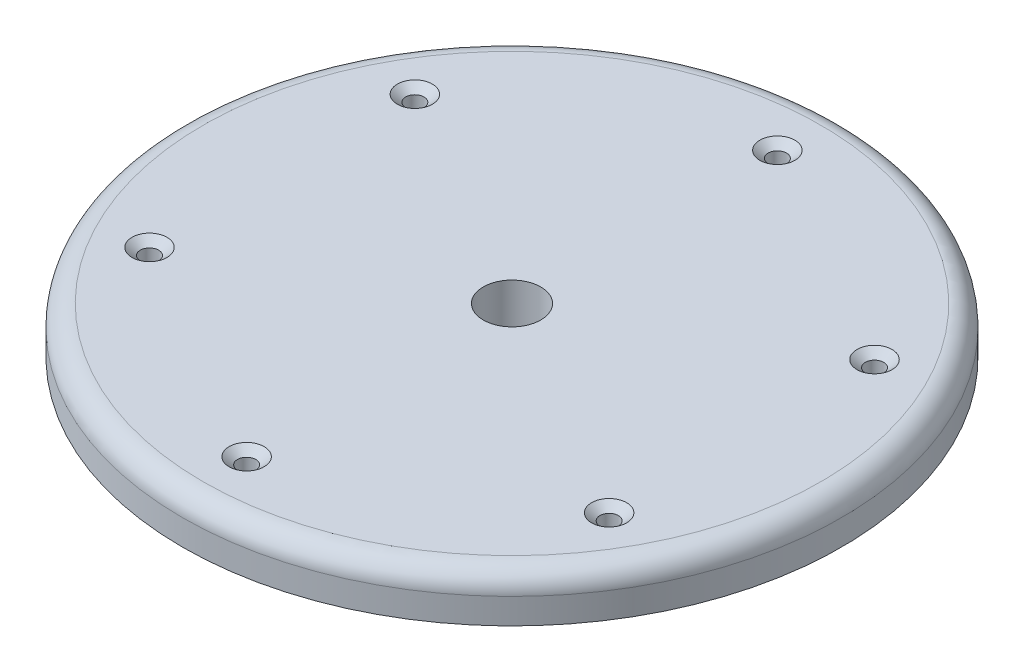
from build123d import *

# Parameters (mm, degrees)
SKETCH1_R                                           = 121.229415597
BOSS_EXTRUDE1_DEPTH                                 = 17.018
CSK_FOR_1_4_FLAT_HEAD_MACHINE_SCREW_100_D           = 6.7564
CSK_FOR_1_4_FLAT_HEAD_MACHINE_SCREW_100_CSINK_D     = 12.8778
CSK_FOR_1_4_FLAT_HEAD_MACHINE_SCREW_100_CSINK_ANGLE = 100
SKETCH5_R                                           = 10.562007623
CUT_EXTRUDE1_DEPTH                                  = 173.286838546
CIRPATTERN1_COUNT                                   = 6
FILLET1_R                                           = 7.62


with BuildPart() as part:
    # Sketch1 → Boss-Extrude1 (new body)
    with BuildSketch(Plane(origin=(0, 0, 0), x_dir=(1, 0, 0), z_dir=(0, 1, 0))):
        with Locations(Location((0, 0, 0), (0, 0, 270))):
            Circle(SKETCH1_R)
    extrude(amount=BOSS_EXTRUDE1_DEPTH)

    # CSK for 1_4 Flat Head Machine Screw _100 (through all)
    with Locations(Plane(origin=(0, 17.018, 0), x_dir=(1, 0, 0), z_dir=(0, 1, 0))):
        with Locations((0, 97.619716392)):
            csk_for_1_4_flat_head_machine_screw_100 = CounterSinkHole(CSK_FOR_1_4_FLAT_HEAD_MACHINE_SCREW_100_D / 2, CSK_FOR_1_4_FLAT_HEAD_MACHINE_SCREW_100_CSINK_D / 2, counter_sink_angle=CSK_FOR_1_4_FLAT_HEAD_MACHINE_SCREW_100_CSINK_ANGLE)

    # Mirror1: CSK for 1_4 Flat Head Machine Screw _100 across plane
    add(csk_for_1_4_flat_head_machine_screw_100.mirror(Plane.XY), mode=Mode.SUBTRACT)

    # Sketch5 → Cut-Extrude1 (cut, through all)
    with BuildSketch(Plane(origin=(0, 17.018, 0), x_dir=(1, 0, 0), z_dir=(0, 1, 0))):
        with Locations(Location((0, 0, 0), (0, 0, 270))):
            Circle(SKETCH5_R)
    extrude(amount=-CUT_EXTRUDE1_DEPTH, mode=Mode.SUBTRACT)

    # CirPattern1: CSK for 1_4 Flat Head Machine Screw _100 ×6 about axis
    cirpattern1_axis = Axis((0, 0, 0), (0, 1, 0))
    for i in range(1, CIRPATTERN1_COUNT):
        add(csk_for_1_4_flat_head_machine_screw_100.rotate(cirpattern1_axis, i * 360 / CIRPATTERN1_COUNT), mode=Mode.SUBTRACT)

    # Fillet1
    fillet1_edges = [part.edges().sort_by_distance(p)[0] for p in [
        (0, 17.018, -121.229415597),
    ]]
    fillet(fillet1_edges, radius=FILLET1_R)


solid = part.part
